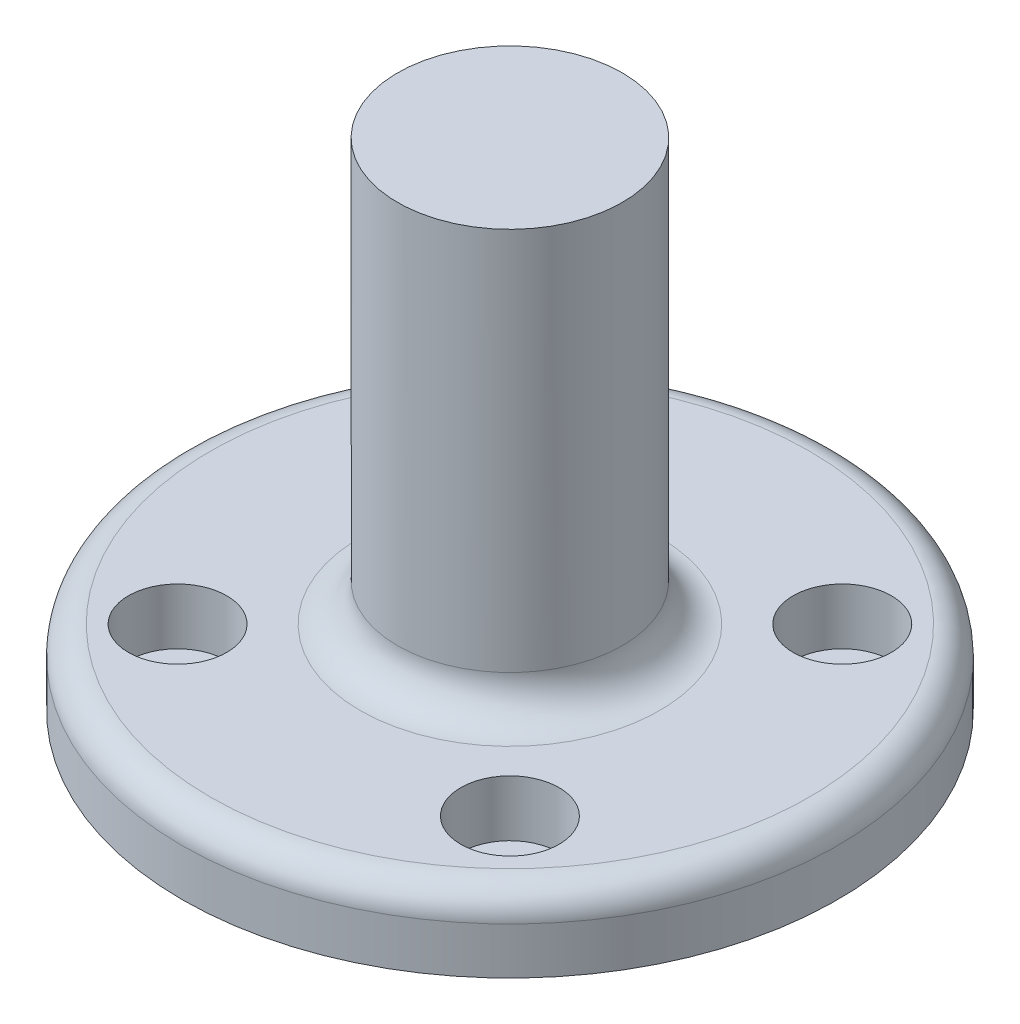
from build123d import *

# Parameters (mm, degrees)
SKETCH1_R           = 35
BOSS_EXTRUDE1_DEPTH = 8
SKETCH2_R           = 5.25
CUT_EXTRUDE1_DEPTH  = 6
SKETCH3_R           = 3.25
CUT_EXTRUDE2_DEPTH  = 2
FILLET1_R           = 4
FILLET3_R           = 3


with BuildPart() as part:
    # Sketch1 → Boss-Extrude1 (new body)
    with BuildSketch(Plane(origin=(0, 0, 0), x_dir=(1, 0, 0), z_dir=(0, 1, 0))):
        with Locations(Location((0, 0, 0), (0, 0, 270))):
            Circle(SKETCH1_R)
    extrude(amount=BOSS_EXTRUDE1_DEPTH)

    # Sketch2 → Cut-Extrude1 (cut)
    with BuildSketch(Plane(origin=(0, 8, 0), x_dir=(1, 0, 0), z_dir=(0, 1, 0))):
        with Locations(Location((-17.75, 17.75, 0), (0, 0, 270))):
            Circle(SKETCH2_R)
        with Locations(Location((17.75, 17.75, 0), (0, 0, 270))):
            Circle(SKETCH2_R)
        with Locations(Location((17.75, -17.75, 0), (0, 0, 270))):
            Circle(SKETCH2_R)
        with Locations(Location((-17.75, -17.75, 0), (0, 0, 270))):
            Circle(SKETCH2_R)
    extrude(amount=-CUT_EXTRUDE1_DEPTH, mode=Mode.SUBTRACT)

    # Sketch3 → Cut-Extrude2 (cut)
    with BuildSketch(Plane(origin=(0, 2, 0), x_dir=(1, 0, 0), z_dir=(0, 1, 0))):
        with Locations(Location((17.75, 17.75, 0), (0, 0, 270))):
            Circle(SKETCH3_R)
        with Locations(Location((-17.75, 17.75, 0), (0, 0, 270))):
            Circle(SKETCH3_R)
        with Locations(Location((-17.75, -17.75, 0), (0, 0, 270))):
            Circle(SKETCH3_R)
        with Locations(Location((17.75, -17.75, 0), (0, 0, 270))):
            Circle(SKETCH3_R)
    extrude(amount=-CUT_EXTRUDE2_DEPTH, mode=Mode.SUBTRACT)

    # Sketch4 → Revolve1 (revolve)
    with BuildSketch(Plane.XY, mode=Mode.PRIVATE) as revolve1_sk:
        Polygon((0, 43), (0, 53), (12, 53), (12, 8), (0, 8), align=None)
    revolve(revolve1_sk.sketch.rotate(Axis((0, 43, 0), (0, 1, 0)), 90), axis=Axis((0, 43, 0), (0, 1, 0)))

    # Fillet1
    fillet1_edges = [part.edges().sort_by_distance(p)[0] for p in [
        (0, 8, 12),
    ]]
    fillet(fillet1_edges, radius=FILLET1_R)

    # Fillet3
    fillet3_edges = [part.edges().sort_by_distance(p)[0] for p in [
        (0, 8, -35),
    ]]
    fillet(fillet3_edges, radius=FILLET3_R)


solid = part.part
